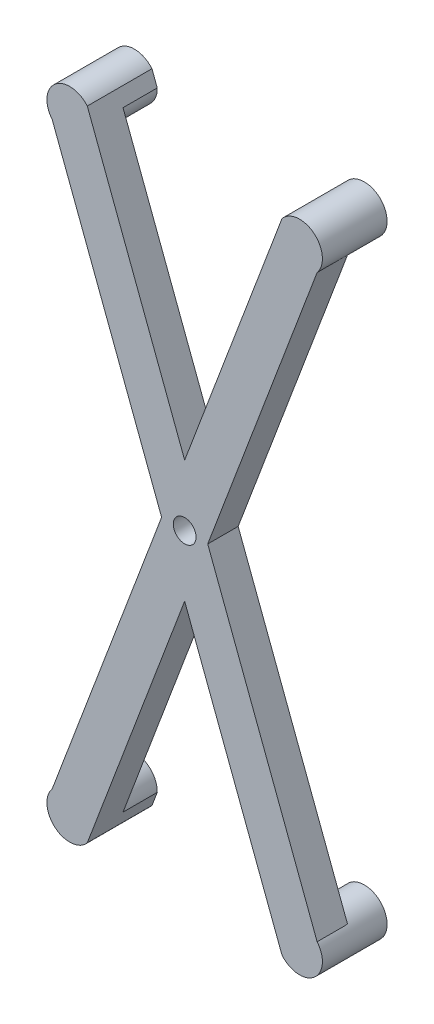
ISO-10303-21;
HEADER;
FILE_DESCRIPTION(('STEP AP214'),'2;1');
FILE_NAME('part.step','',(''),(''),'','','');
FILE_SCHEMA(('AUTOMOTIVE_DESIGN { 1 0 10303 214 1 1 1 1 }'));
ENDSEC;
DATA;
#1=APPLICATION_CONTEXT('core data for automotive mechanical design processes');
#2=APPLICATION_PROTOCOL_DEFINITION('international standard','automotive_design',2000,#1);
#3=PRODUCT_CONTEXT('',#1,'mechanical');
#4=PRODUCT('Part','Part','',(#3));
#5=PRODUCT_RELATED_PRODUCT_CATEGORY('part','',(#4));
#6=PRODUCT_DEFINITION_FORMATION('','',#4);
#7=PRODUCT_DEFINITION_CONTEXT('part definition',#1,'design');
#8=PRODUCT_DEFINITION('design','',#6,#7);
#9=PRODUCT_DEFINITION_SHAPE('','',#8);
#10=(LENGTH_UNIT() NAMED_UNIT(*) SI_UNIT(.MILLI.,.METRE.));
#11=(NAMED_UNIT(*) PLANE_ANGLE_UNIT() SI_UNIT($,.RADIAN.));
#12=(NAMED_UNIT(*) SI_UNIT($,.STERADIAN.) SOLID_ANGLE_UNIT());
#13=UNCERTAINTY_MEASURE_WITH_UNIT(LENGTH_MEASURE(1.E-05),#10,'distance_accuracy_value','');
#14=(GEOMETRIC_REPRESENTATION_CONTEXT(3) GLOBAL_UNCERTAINTY_ASSIGNED_CONTEXT((#13)) GLOBAL_UNIT_ASSIGNED_CONTEXT((#10,
#11,#12)) REPRESENTATION_CONTEXT('',''));
#15=CARTESIAN_POINT('',(0.,0.,0.));
#16=DIRECTION('',(0.,0.,1.));
#17=DIRECTION('',(1.,0.,0.));
#18=AXIS2_PLACEMENT_3D('',#15,#16,#17);
#19=CARTESIAN_POINT('',(0.,0.,0.));
#20=DIRECTION('',(0.,0.,1.));
#21=DIRECTION('',(1.,0.,0.));
#22=AXIS2_PLACEMENT_3D('',#19,#20,#21);
#23=PLANE('',#22);
#24=CARTESIAN_POINT('',(-42.7199448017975,0.467880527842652,0.));
#25=DIRECTION('',(0.,0.,1.));
#26=DIRECTION('',(1.,0.,0.));
#27=AXIS2_PLACEMENT_3D('',#24,#25,#26);
#28=CIRCLE('',#27,1.5);
#29=CARTESIAN_POINT('',(-41.2199448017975,0.467880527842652,0.));
#30=VERTEX_POINT('',#29);
#31=EDGE_CURVE('E297',#30,#30,#28,.T.);
#32=ORIENTED_EDGE('',*,*,#31,.T.);
#33=EDGE_LOOP('',(#32));
#34=FACE_BOUND('',#33,.T.);
#35=CARTESIAN_POINT('',(-27.6199448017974,-39.5321194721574,0.));
#36=DIRECTION('',(0.,0.,-1.));
#37=DIRECTION('',(-1.,0.,0.));
#38=AXIS2_PLACEMENT_3D('',#35,#36,#37);
#39=CIRCLE('',#38,2.99999999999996);
#40=CARTESIAN_POINT('',(-30.618836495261,-39.6136584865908,0.));
#41=VERTEX_POINT('',#40);
#42=CARTESIAN_POINT('',(-25.3152809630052,-37.6115662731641,0.));
#43=VERTEX_POINT('',#42);
#44=EDGE_CURVE('E379',#41,#43,#39,.T.);
#45=ORIENTED_EDGE('',*,*,#44,.F.);
#46=DIRECTION('',(0.353173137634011,-0.935557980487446,0.));
#47=VECTOR('',#46,1.);
#48=CARTESIAN_POINT('',(-39.8886155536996,-15.0579523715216,0.));
#49=LINE('',#48,#47);
#50=CARTESIAN_POINT('',(-42.7199448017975,-7.55774244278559,0.));
#51=VERTEX_POINT('',#50);
#52=EDGE_CURVE('E289',#51,#41,#49,.T.);
#53=ORIENTED_EDGE('',*,*,#52,.F.);
#54=DIRECTION('',(-0.353173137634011,-0.935557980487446,0.));
#55=VECTOR('',#54,1.);
#56=CARTESIAN_POINT('',(-34.8942485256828,13.1725788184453,0.));
#57=LINE('',#56,#55);
#58=CARTESIAN_POINT('',(-54.8210531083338,-39.6136584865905,0.));
#59=VERTEX_POINT('',#58);
#60=EDGE_CURVE('E167',#51,#59,#57,.T.);
#61=ORIENTED_EDGE('',*,*,#60,.T.);
#62=CARTESIAN_POINT('',(-57.8199448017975,-39.5321194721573,0.));
#63=DIRECTION('',(0.,0.,-1.));
#64=DIRECTION('',(-1.,0.,0.));
#65=AXIS2_PLACEMENT_3D('',#62,#63,#64);
#66=CIRCLE('',#65,3.);
#67=CARTESIAN_POINT('',(-60.1246086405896,-37.6115662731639,0.));
#68=VERTEX_POINT('',#67);
#69=EDGE_CURVE('E418',#68,#59,#66,.T.);
#70=ORIENTED_EDGE('',*,*,#69,.F.);
#71=DIRECTION('',(-0.353173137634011,-0.935557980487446,0.));
#72=VECTOR('',#71,1.);
#73=CARTESIAN_POINT('',(-40.1978040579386,15.1746710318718,0.));
#74=LINE('',#73,#72);
#75=CARTESIAN_POINT('',(-45.7496174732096,0.467880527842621,0.));
#76=VERTEX_POINT('',#75);
#77=EDGE_CURVE('E285',#76,#68,#74,.T.);
#78=ORIENTED_EDGE('',*,*,#77,.F.);
#79=DIRECTION('',(0.353173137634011,-0.935557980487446,0.));
#80=VECTOR('',#79,1.);
#81=CARTESIAN_POINT('',(-39.8886155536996,-15.0579523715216,0.));
#82=LINE('',#81,#80);
#83=CARTESIAN_POINT('',(-60.1246086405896,38.5473273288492,0.));
#84=VERTEX_POINT('',#83);
#85=EDGE_CURVE('E281',#84,#76,#82,.T.);
#86=ORIENTED_EDGE('',*,*,#85,.F.);
#87=CARTESIAN_POINT('',(-57.8199448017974,40.4678805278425,0.));
#88=DIRECTION('',(0.,0.,-1.));
#89=DIRECTION('',(-1.,0.,0.));
#90=AXIS2_PLACEMENT_3D('',#87,#88,#89);
#91=CIRCLE('',#90,2.99999999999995);
#92=CARTESIAN_POINT('',(-54.8210531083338,40.5494195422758,0.));
#93=VERTEX_POINT('',#92);
#94=EDGE_CURVE('E346',#93,#84,#91,.T.);
#95=ORIENTED_EDGE('',*,*,#94,.F.);
#96=DIRECTION('',(0.353173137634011,-0.935557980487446,0.));
#97=VECTOR('',#96,1.);
#98=CARTESIAN_POINT('',(-34.5850600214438,-13.055860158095,0.));
#99=LINE('',#98,#97);
#100=CARTESIAN_POINT('',(-42.7199448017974,8.49350349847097,0.));
#101=VERTEX_POINT('',#100);
#102=EDGE_CURVE('E279',#93,#101,#99,.T.);
#103=ORIENTED_EDGE('',*,*,#102,.T.);
#104=DIRECTION('',(-0.353173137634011,-0.935557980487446,0.));
#105=VECTOR('',#104,1.);
#106=CARTESIAN_POINT('',(-40.1978040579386,15.1746710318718,0.));
#107=LINE('',#106,#105);
#108=CARTESIAN_POINT('',(-30.6188364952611,40.5494195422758,0.));
#109=VERTEX_POINT('',#108);
#110=EDGE_CURVE('E205',#109,#101,#107,.T.);
#111=ORIENTED_EDGE('',*,*,#110,.F.);
#112=CARTESIAN_POINT('',(-27.6199448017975,40.4678805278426,0.));
#113=DIRECTION('',(0.,0.,1.));
#114=DIRECTION('',(1.,0.,0.));
#115=AXIS2_PLACEMENT_3D('',#112,#113,#114);
#116=CIRCLE('',#115,3.);
#117=CARTESIAN_POINT('',(-25.3152809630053,38.5473273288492,0.));
#118=VERTEX_POINT('',#117);
#119=EDGE_CURVE('E12',#118,#109,#116,.F.);
#120=ORIENTED_EDGE('',*,*,#119,.F.);
#121=DIRECTION('',(-0.353173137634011,-0.935557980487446,0.));
#122=VECTOR('',#121,1.);
#123=CARTESIAN_POINT('',(-34.8942485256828,13.1725788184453,0.));
#124=LINE('',#123,#122);
#125=CARTESIAN_POINT('',(-39.6902721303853,0.467880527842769,0.));
#126=VERTEX_POINT('',#125);
#127=EDGE_CURVE('E253',#118,#126,#124,.T.);
#128=ORIENTED_EDGE('',*,*,#127,.T.);
#129=DIRECTION('',(0.353173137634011,-0.935557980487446,0.));
#130=VECTOR('',#129,1.);
#131=CARTESIAN_POINT('',(-34.5850600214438,-13.055860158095,0.));
#132=LINE('',#131,#130);
#133=EDGE_CURVE('E292',#126,#43,#132,.T.);
#134=ORIENTED_EDGE('',*,*,#133,.T.);
#135=EDGE_LOOP('',(#45,#53,#61,#70,#78,#86,#95,#103,#111,#120,#128,#134));
#136=FACE_BOUND('',#135,.T.);
#137=ADVANCED_FACE('F152',(#34,#136),#23,.F.);
#138=CARTESIAN_POINT('',(-42.7199448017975,0.467880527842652,4.));
#139=DIRECTION('',(0.,0.,-1.));
#140=DIRECTION('',(-1.,0.,0.));
#141=AXIS2_PLACEMENT_3D('',#138,#139,#140);
#142=CYLINDRICAL_SURFACE('',#141,1.5);
#143=CARTESIAN_POINT('',(-42.7199448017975,0.467880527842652,4.));
#144=DIRECTION('',(0.,0.,1.));
#145=DIRECTION('',(1.,0.,0.));
#146=AXIS2_PLACEMENT_3D('',#143,#144,#145);
#147=CIRCLE('',#146,1.5);
#148=CARTESIAN_POINT('',(-41.2199448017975,0.467880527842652,4.));
#149=VERTEX_POINT('',#148);
#150=EDGE_CURVE('E275',#149,#149,#147,.T.);
#151=ORIENTED_EDGE('',*,*,#150,.T.);
#152=EDGE_LOOP('',(#151));
#153=FACE_BOUND('',#152,.T.);
#154=ORIENTED_EDGE('',*,*,#31,.F.);
#155=EDGE_LOOP('',(#154));
#156=FACE_BOUND('',#155,.T.);
#157=ADVANCED_FACE('F487',(#153,#156),#142,.F.);
#158=CARTESIAN_POINT('',(-57.8199448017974,40.4678805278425,4.));
#159=DIRECTION('',(0.,0.,-1.));
#160=DIRECTION('',(-1.,0.,0.));
#161=AXIS2_PLACEMENT_3D('',#158,#159,#160);
#162=CYLINDRICAL_SURFACE('',#161,2.99999999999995);
#163=DIRECTION('',(0.,0.,-1.));
#164=VECTOR('',#163,1.);
#165=CARTESIAN_POINT('',(-55.5152809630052,42.3884337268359,4.));
#166=LINE('',#165,#164);
#167=CARTESIAN_POINT('',(-55.5152809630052,42.3884337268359,4.));
#168=VERTEX_POINT('',#167);
#169=CARTESIAN_POINT('',(-55.5152809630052,42.3884337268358,-4.5));
#170=VERTEX_POINT('',#169);
#171=EDGE_CURVE('E160',#168,#170,#166,.T.);
#172=ORIENTED_EDGE('',*,*,#171,.T.);
#173=CARTESIAN_POINT('',(-57.8199448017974,40.4678805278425,-4.5));
#174=DIRECTION('',(0.,0.,-1.));
#175=DIRECTION('',(-1.,0.,0.));
#176=AXIS2_PLACEMENT_3D('',#173,#174,#175);
#177=CIRCLE('',#176,2.99999999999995);
#178=CARTESIAN_POINT('',(-54.8210531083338,40.5494195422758,-4.5));
#179=VERTEX_POINT('',#178);
#180=EDGE_CURVE('E330',#179,#170,#177,.T.);
#181=ORIENTED_EDGE('',*,*,#180,.F.);
#182=DIRECTION('',(0.,0.,1.));
#183=VECTOR('',#182,1.);
#184=CARTESIAN_POINT('',(-54.8210531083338,40.5494195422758,-4.5));
#185=LINE('',#184,#183);
#186=EDGE_CURVE('E282',#179,#93,#185,.T.);
#187=ORIENTED_EDGE('',*,*,#186,.T.);
#188=ORIENTED_EDGE('',*,*,#94,.T.);
#189=DIRECTION('',(0.,0.,-1.));
#190=VECTOR('',#189,1.);
#191=CARTESIAN_POINT('',(-60.1246086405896,38.5473273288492,4.));
#192=LINE('',#191,#190);
#193=CARTESIAN_POINT('',(-60.1246086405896,38.5473273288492,4.));
#194=VERTEX_POINT('',#193);
#195=EDGE_CURVE('E322',#194,#84,#192,.T.);
#196=ORIENTED_EDGE('',*,*,#195,.F.);
#197=CARTESIAN_POINT('',(-57.8199448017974,40.4678805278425,4.));
#198=DIRECTION('',(0.,0.,1.));
#199=DIRECTION('',(1.,0.,0.));
#200=AXIS2_PLACEMENT_3D('',#197,#198,#199);
#201=CIRCLE('',#200,2.99999999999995);
#202=EDGE_CURVE('E334',#168,#194,#201,.T.);
#203=ORIENTED_EDGE('',*,*,#202,.F.);
#204=EDGE_LOOP('',(#172,#181,#187,#188,#196,#203));
#205=FACE_BOUND('',#204,.T.);
#206=ADVANCED_FACE('F327',(#205),#162,.T.);
#207=CARTESIAN_POINT('',(-39.8886155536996,-15.0579523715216,4.));
#208=DIRECTION('',(0.935557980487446,0.353173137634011,0.));
#209=DIRECTION('',(-0.353173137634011,0.935557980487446,0.));
#210=AXIS2_PLACEMENT_3D('',#207,#208,#209);
#211=PLANE('',#210);
#212=ORIENTED_EDGE('',*,*,#85,.T.);
#213=DIRECTION('',(0.,0.,-1.));
#214=VECTOR('',#213,1.);
#215=CARTESIAN_POINT('',(-45.7496174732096,0.467880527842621,4.));
#216=LINE('',#215,#214);
#217=CARTESIAN_POINT('',(-45.7496174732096,0.467880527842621,4.));
#218=VERTEX_POINT('',#217);
#219=EDGE_CURVE('E319',#218,#76,#216,.T.);
#220=ORIENTED_EDGE('',*,*,#219,.F.);
#221=DIRECTION('',(0.353173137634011,-0.935557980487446,0.));
#222=VECTOR('',#221,1.);
#223=CARTESIAN_POINT('',(-39.8886155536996,-15.0579523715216,4.));
#224=LINE('',#223,#222);
#225=EDGE_CURVE('E358',#194,#218,#224,.T.);
#226=ORIENTED_EDGE('',*,*,#225,.F.);
#227=ORIENTED_EDGE('',*,*,#195,.T.);
#228=EDGE_LOOP('',(#212,#220,#226,#227));
#229=FACE_BOUND('',#228,.T.);
#230=ADVANCED_FACE('F558',(#229),#211,.F.);
#231=CARTESIAN_POINT('',(-40.1978040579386,15.1746710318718,4.));
#232=DIRECTION('',(0.935557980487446,-0.353173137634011,0.));
#233=DIRECTION('',(0.353173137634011,0.935557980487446,0.));
#234=AXIS2_PLACEMENT_3D('',#231,#232,#233);
#235=PLANE('',#234);
#236=ORIENTED_EDGE('',*,*,#77,.T.);
#237=DIRECTION('',(0.,0.,-1.));
#238=VECTOR('',#237,1.);
#239=CARTESIAN_POINT('',(-60.1246086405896,-37.6115662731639,4.));
#240=LINE('',#239,#238);
#241=CARTESIAN_POINT('',(-60.1246086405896,-37.6115662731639,4.));
#242=VERTEX_POINT('',#241);
#243=EDGE_CURVE('E316',#242,#68,#240,.T.);
#244=ORIENTED_EDGE('',*,*,#243,.F.);
#245=DIRECTION('',(-0.353173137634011,-0.935557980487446,0.));
#246=VECTOR('',#245,1.);
#247=CARTESIAN_POINT('',(-40.1978040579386,15.1746710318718,4.));
#248=LINE('',#247,#246);
#249=EDGE_CURVE('E361',#218,#242,#248,.T.);
#250=ORIENTED_EDGE('',*,*,#249,.F.);
#251=ORIENTED_EDGE('',*,*,#219,.T.);
#252=EDGE_LOOP('',(#236,#244,#250,#251));
#253=FACE_BOUND('',#252,.T.);
#254=ADVANCED_FACE('F554',(#253),#235,.F.);
#255=CARTESIAN_POINT('',(-57.8199448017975,-39.5321194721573,4.));
#256=DIRECTION('',(0.,0.,-1.));
#257=DIRECTION('',(-1.,0.,0.));
#258=AXIS2_PLACEMENT_3D('',#255,#256,#257);
#259=CYLINDRICAL_SURFACE('',#258,3.);
#260=ORIENTED_EDGE('',*,*,#243,.T.);
#261=ORIENTED_EDGE('',*,*,#69,.T.);
#262=DIRECTION('',(0.,0.,1.));
#263=VECTOR('',#262,1.);
#264=CARTESIAN_POINT('',(-54.8210531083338,-39.6136584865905,-4.5));
#265=LINE('',#264,#263);
#266=CARTESIAN_POINT('',(-54.8210531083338,-39.6136584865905,-4.5));
#267=VERTEX_POINT('',#266);
#268=EDGE_CURVE('E404',#267,#59,#265,.T.);
#269=ORIENTED_EDGE('',*,*,#268,.F.);
#270=CARTESIAN_POINT('',(-57.8199448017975,-39.5321194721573,-4.5));
#271=DIRECTION('',(0.,0.,-1.));
#272=DIRECTION('',(-1.,0.,0.));
#273=AXIS2_PLACEMENT_3D('',#270,#271,#272);
#274=CIRCLE('',#273,3.);
#275=CARTESIAN_POINT('',(-55.5152809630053,-41.4526726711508,-4.5));
#276=VERTEX_POINT('',#275);
#277=EDGE_CURVE('E409',#276,#267,#274,.T.);
#278=ORIENTED_EDGE('',*,*,#277,.F.);
#279=DIRECTION('',(0.,0.,-1.));
#280=VECTOR('',#279,1.);
#281=CARTESIAN_POINT('',(-55.5152809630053,-41.4526726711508,4.));
#282=LINE('',#281,#280);
#283=CARTESIAN_POINT('',(-55.5152809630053,-41.4526726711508,4.));
#284=VERTEX_POINT('',#283);
#285=EDGE_CURVE('E313',#284,#276,#282,.T.);
#286=ORIENTED_EDGE('',*,*,#285,.F.);
#287=CARTESIAN_POINT('',(-57.8199448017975,-39.5321194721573,4.));
#288=DIRECTION('',(0.,0.,1.));
#289=DIRECTION('',(1.,0.,0.));
#290=AXIS2_PLACEMENT_3D('',#287,#288,#289);
#291=CIRCLE('',#290,3.);
#292=EDGE_CURVE('E364',#242,#284,#291,.T.);
#293=ORIENTED_EDGE('',*,*,#292,.F.);
#294=EDGE_LOOP('',(#260,#261,#269,#278,#286,#293));
#295=FACE_BOUND('',#294,.T.);
#296=ADVANCED_FACE('F551',(#295),#259,.T.);
#297=CARTESIAN_POINT('',(-34.8942485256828,13.1725788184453,4.));
#298=DIRECTION('',(0.935557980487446,-0.353173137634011,0.));
#299=DIRECTION('',(0.353173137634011,0.935557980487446,0.));
#300=AXIS2_PLACEMENT_3D('',#297,#298,#299);
#301=PLANE('',#300);
#302=ORIENTED_EDGE('',*,*,#60,.F.);
#303=DIRECTION('',(0.,0.,-1.));
#304=VECTOR('',#303,1.);
#305=CARTESIAN_POINT('',(-42.7199448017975,-7.55774244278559,4.));
#306=LINE('',#305,#304);
#307=CARTESIAN_POINT('',(-42.7199448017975,-7.55774244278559,4.));
#308=VERTEX_POINT('',#307);
#309=EDGE_CURVE('E311',#308,#51,#306,.T.);
#310=ORIENTED_EDGE('',*,*,#309,.F.);
#311=DIRECTION('',(-0.353173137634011,-0.935557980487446,0.));
#312=VECTOR('',#311,1.);
#313=CARTESIAN_POINT('',(-34.8942485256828,13.1725788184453,4.));
#314=LINE('',#313,#312);
#315=EDGE_CURVE('E366',#308,#284,#314,.T.);
#316=ORIENTED_EDGE('',*,*,#315,.T.);
#317=ORIENTED_EDGE('',*,*,#285,.T.);
#318=DIRECTION('',(-0.353173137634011,-0.935557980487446,0.));
#319=VECTOR('',#318,1.);
#320=CARTESIAN_POINT('',(-34.8942485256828,13.1725788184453,-4.5));
#321=LINE('',#320,#319);
#322=EDGE_CURVE('E415',#267,#276,#321,.T.);
#323=ORIENTED_EDGE('',*,*,#322,.F.);
#324=ORIENTED_EDGE('',*,*,#268,.T.);
#325=EDGE_LOOP('',(#302,#310,#316,#317,#323,#324));
#326=FACE_BOUND('',#325,.T.);
#327=ADVANCED_FACE('F547',(#326),#301,.T.);
#328=CARTESIAN_POINT('',(-39.8886155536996,-15.0579523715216,4.));
#329=DIRECTION('',(0.935557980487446,0.353173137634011,0.));
#330=DIRECTION('',(-0.353173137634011,0.935557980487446,0.));
#331=AXIS2_PLACEMENT_3D('',#328,#329,#330);
#332=PLANE('',#331);
#333=ORIENTED_EDGE('',*,*,#52,.T.);
#334=DIRECTION('',(0.,0.,1.));
#335=VECTOR('',#334,1.);
#336=CARTESIAN_POINT('',(-30.618836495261,-39.6136584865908,-4.5));
#337=LINE('',#336,#335);
#338=CARTESIAN_POINT('',(-30.618836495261,-39.6136584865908,-4.5));
#339=VERTEX_POINT('',#338);
#340=EDGE_CURVE('E423',#339,#41,#337,.T.);
#341=ORIENTED_EDGE('',*,*,#340,.F.);
#342=DIRECTION('',(-0.353173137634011,0.935557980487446,0.));
#343=VECTOR('',#342,1.);
#344=CARTESIAN_POINT('',(-39.8886155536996,-15.0579523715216,-4.5));
#345=LINE('',#344,#343);
#346=CARTESIAN_POINT('',(-29.9246086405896,-41.4526726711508,-4.5));
#347=VERTEX_POINT('',#346);
#348=EDGE_CURVE('E430',#347,#339,#345,.T.);
#349=ORIENTED_EDGE('',*,*,#348,.F.);
#350=DIRECTION('',(0.,0.,-1.));
#351=VECTOR('',#350,1.);
#352=CARTESIAN_POINT('',(-29.9246086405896,-41.4526726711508,4.));
#353=LINE('',#352,#351);
#354=CARTESIAN_POINT('',(-29.9246086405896,-41.4526726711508,4.));
#355=VERTEX_POINT('',#354);
#356=EDGE_CURVE('E308',#355,#347,#353,.T.);
#357=ORIENTED_EDGE('',*,*,#356,.F.);
#358=DIRECTION('',(0.353173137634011,-0.935557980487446,0.));
#359=VECTOR('',#358,1.);
#360=CARTESIAN_POINT('',(-39.8886155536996,-15.0579523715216,4.));
#361=LINE('',#360,#359);
#362=EDGE_CURVE('E369',#308,#355,#361,.T.);
#363=ORIENTED_EDGE('',*,*,#362,.F.);
#364=ORIENTED_EDGE('',*,*,#309,.T.);
#365=EDGE_LOOP('',(#333,#341,#349,#357,#363,#364));
#366=FACE_BOUND('',#365,.T.);
#367=ADVANCED_FACE('F544',(#366),#332,.F.);
#368=CARTESIAN_POINT('',(-27.6199448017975,-39.5321194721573,4.));
#369=DIRECTION('',(0.,0.,-1.));
#370=DIRECTION('',(-1.,0.,0.));
#371=AXIS2_PLACEMENT_3D('',#368,#369,#370);
#372=CYLINDRICAL_SURFACE('',#371,3.);
#373=ORIENTED_EDGE('',*,*,#356,.T.);
#374=CARTESIAN_POINT('',(-27.6199448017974,-39.5321194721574,-4.5));
#375=DIRECTION('',(0.,0.,-1.));
#376=DIRECTION('',(-1.,0.,0.));
#377=AXIS2_PLACEMENT_3D('',#374,#375,#376);
#378=CIRCLE('',#377,2.99999999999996);
#379=EDGE_CURVE('E438',#339,#347,#378,.T.);
#380=ORIENTED_EDGE('',*,*,#379,.F.);
#381=ORIENTED_EDGE('',*,*,#340,.T.);
#382=ORIENTED_EDGE('',*,*,#44,.T.);
#383=DIRECTION('',(0.,0.,-1.));
#384=VECTOR('',#383,1.);
#385=CARTESIAN_POINT('',(-25.3152809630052,-37.6115662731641,4.));
#386=LINE('',#385,#384);
#387=CARTESIAN_POINT('',(-25.3152809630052,-37.6115662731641,4.));
#388=VERTEX_POINT('',#387);
#389=EDGE_CURVE('E305',#388,#43,#386,.T.);
#390=ORIENTED_EDGE('',*,*,#389,.F.);
#391=CARTESIAN_POINT('',(-27.6199448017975,-39.5321194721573,4.));
#392=DIRECTION('',(0.,0.,1.));
#393=DIRECTION('',(1.,0.,0.));
#394=AXIS2_PLACEMENT_3D('',#391,#392,#393);
#395=CIRCLE('',#394,3.);
#396=EDGE_CURVE('E270',#355,#388,#395,.T.);
#397=ORIENTED_EDGE('',*,*,#396,.F.);
#398=EDGE_LOOP('',(#373,#380,#381,#382,#390,#397));
#399=FACE_BOUND('',#398,.T.);
#400=ADVANCED_FACE('F376',(#399),#372,.T.);
#401=CARTESIAN_POINT('',(-34.5850600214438,-13.055860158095,4.));
#402=DIRECTION('',(0.935557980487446,0.353173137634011,0.));
#403=DIRECTION('',(-0.353173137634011,0.935557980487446,0.));
#404=AXIS2_PLACEMENT_3D('',#401,#402,#403);
#405=PLANE('',#404);
#406=ORIENTED_EDGE('',*,*,#133,.F.);
#407=DIRECTION('',(0.,0.,-1.));
#408=VECTOR('',#407,1.);
#409=CARTESIAN_POINT('',(-39.6902721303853,0.467880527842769,4.));
#410=LINE('',#409,#408);
#411=CARTESIAN_POINT('',(-39.6902721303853,0.467880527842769,4.));
#412=VERTEX_POINT('',#411);
#413=EDGE_CURVE('E255',#412,#126,#410,.T.);
#414=ORIENTED_EDGE('',*,*,#413,.F.);
#415=DIRECTION('',(0.353173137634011,-0.935557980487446,0.));
#416=VECTOR('',#415,1.);
#417=CARTESIAN_POINT('',(-34.5850600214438,-13.055860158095,4.));
#418=LINE('',#417,#416);
#419=EDGE_CURVE('E268',#412,#388,#418,.T.);
#420=ORIENTED_EDGE('',*,*,#419,.T.);
#421=ORIENTED_EDGE('',*,*,#389,.T.);
#422=EDGE_LOOP('',(#406,#414,#420,#421));
#423=FACE_BOUND('',#422,.T.);
#424=ADVANCED_FACE('F382',(#423),#405,.T.);
#425=CARTESIAN_POINT('',(-34.8942485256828,13.1725788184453,4.));
#426=DIRECTION('',(0.935557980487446,-0.353173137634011,0.));
#427=DIRECTION('',(0.353173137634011,0.935557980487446,0.));
#428=AXIS2_PLACEMENT_3D('',#425,#426,#427);
#429=PLANE('',#428);
#430=ORIENTED_EDGE('',*,*,#127,.F.);
#431=DIRECTION('',(0.,0.,-1.));
#432=VECTOR('',#431,1.);
#433=CARTESIAN_POINT('',(-25.3152809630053,38.5473273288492,4.));
#434=LINE('',#433,#432);
#435=CARTESIAN_POINT('',(-25.3152809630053,38.5473273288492,4.));
#436=VERTEX_POINT('',#435);
#437=EDGE_CURVE('E246',#436,#118,#434,.T.);
#438=ORIENTED_EDGE('',*,*,#437,.F.);
#439=DIRECTION('',(-0.353173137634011,-0.935557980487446,0.));
#440=VECTOR('',#439,1.);
#441=CARTESIAN_POINT('',(-34.8942485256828,13.1725788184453,4.));
#442=LINE('',#441,#440);
#443=EDGE_CURVE('E250',#436,#412,#442,.T.);
#444=ORIENTED_EDGE('',*,*,#443,.T.);
#445=ORIENTED_EDGE('',*,*,#413,.T.);
#446=EDGE_LOOP('',(#430,#438,#444,#445));
#447=FACE_BOUND('',#446,.T.);
#448=ADVANCED_FACE('F248',(#447),#429,.T.);
#449=CARTESIAN_POINT('',(-27.6199448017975,40.4678805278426,4.));
#450=DIRECTION('',(0.,0.,-1.));
#451=DIRECTION('',(-1.,0.,0.));
#452=AXIS2_PLACEMENT_3D('',#449,#450,#451);
#453=CYLINDRICAL_SURFACE('',#452,3.);
#454=ORIENTED_EDGE('',*,*,#437,.T.);
#455=ORIENTED_EDGE('',*,*,#119,.T.);
#456=DIRECTION('',(0.,0.,1.));
#457=VECTOR('',#456,1.);
#458=CARTESIAN_POINT('',(-30.6188364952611,40.5494195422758,-4.5));
#459=LINE('',#458,#457);
#460=CARTESIAN_POINT('',(-30.6188364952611,40.5494195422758,-4.5));
#461=VERTEX_POINT('',#460);
#462=EDGE_CURVE('E349',#461,#109,#459,.T.);
#463=ORIENTED_EDGE('',*,*,#462,.F.);
#464=CARTESIAN_POINT('',(-27.6199448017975,40.4678805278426,-4.5));
#465=DIRECTION('',(0.,0.,-1.));
#466=DIRECTION('',(-1.,0.,0.));
#467=AXIS2_PLACEMENT_3D('',#464,#465,#466);
#468=CIRCLE('',#467,3.);
#469=CARTESIAN_POINT('',(-29.9246086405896,42.3884337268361,-4.5));
#470=VERTEX_POINT('',#469);
#471=EDGE_CURVE('E395',#470,#461,#468,.T.);
#472=ORIENTED_EDGE('',*,*,#471,.F.);
#473=DIRECTION('',(0.,0.,-1.));
#474=VECTOR('',#473,1.);
#475=CARTESIAN_POINT('',(-29.9246086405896,42.3884337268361,4.));
#476=LINE('',#475,#474);
#477=CARTESIAN_POINT('',(-29.9246086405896,42.3884337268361,4.));
#478=VERTEX_POINT('',#477);
#479=EDGE_CURVE('E256',#478,#470,#476,.T.);
#480=ORIENTED_EDGE('',*,*,#479,.F.);
#481=CARTESIAN_POINT('',(-27.6199448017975,40.4678805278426,4.));
#482=DIRECTION('',(0.,0.,1.));
#483=DIRECTION('',(1.,0.,0.));
#484=AXIS2_PLACEMENT_3D('',#481,#482,#483);
#485=CIRCLE('',#484,3.);
#486=EDGE_CURVE('E259',#436,#478,#485,.T.);
#487=ORIENTED_EDGE('',*,*,#486,.F.);
#488=EDGE_LOOP('',(#454,#455,#463,#472,#480,#487));
#489=FACE_BOUND('',#488,.T.);
#490=ADVANCED_FACE('F260',(#489),#453,.T.);
#491=CARTESIAN_POINT('',(-40.1978040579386,15.1746710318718,4.));
#492=DIRECTION('',(0.935557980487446,-0.353173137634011,0.));
#493=DIRECTION('',(0.353173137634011,0.935557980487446,0.));
#494=AXIS2_PLACEMENT_3D('',#491,#492,#493);
#495=PLANE('',#494);
#496=ORIENTED_EDGE('',*,*,#479,.T.);
#497=DIRECTION('',(0.353173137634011,0.935557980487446,0.));
#498=VECTOR('',#497,1.);
#499=CARTESIAN_POINT('',(-40.1978040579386,15.1746710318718,-4.5));
#500=LINE('',#499,#498);
#501=EDGE_CURVE('E394',#461,#470,#500,.T.);
#502=ORIENTED_EDGE('',*,*,#501,.F.);
#503=ORIENTED_EDGE('',*,*,#462,.T.);
#504=ORIENTED_EDGE('',*,*,#110,.T.);
#505=DIRECTION('',(0.,0.,-1.));
#506=VECTOR('',#505,1.);
#507=CARTESIAN_POINT('',(-42.7199448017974,8.49350349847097,4.));
#508=LINE('',#507,#506);
#509=CARTESIAN_POINT('',(-42.7199448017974,8.49350349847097,4.));
#510=VERTEX_POINT('',#509);
#511=EDGE_CURVE('E278',#510,#101,#508,.T.);
#512=ORIENTED_EDGE('',*,*,#511,.F.);
#513=DIRECTION('',(-0.353173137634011,-0.935557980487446,0.));
#514=VECTOR('',#513,1.);
#515=CARTESIAN_POINT('',(-40.1978040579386,15.1746710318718,4.));
#516=LINE('',#515,#514);
#517=EDGE_CURVE('E176',#478,#510,#516,.T.);
#518=ORIENTED_EDGE('',*,*,#517,.F.);
#519=EDGE_LOOP('',(#496,#502,#503,#504,#512,#518));
#520=FACE_BOUND('',#519,.T.);
#521=ADVANCED_FACE('F392',(#520),#495,.F.);
#522=CARTESIAN_POINT('',(-34.5850600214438,-13.055860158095,4.));
#523=DIRECTION('',(0.935557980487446,0.353173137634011,0.));
#524=DIRECTION('',(-0.353173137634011,0.935557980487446,0.));
#525=AXIS2_PLACEMENT_3D('',#522,#523,#524);
#526=PLANE('',#525);
#527=ORIENTED_EDGE('',*,*,#102,.F.);
#528=ORIENTED_EDGE('',*,*,#186,.F.);
#529=DIRECTION('',(0.353173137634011,-0.935557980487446,0.));
#530=VECTOR('',#529,1.);
#531=CARTESIAN_POINT('',(-34.5850600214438,-13.055860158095,-4.5));
#532=LINE('',#531,#530);
#533=EDGE_CURVE('E338',#170,#179,#532,.T.);
#534=ORIENTED_EDGE('',*,*,#533,.F.);
#535=ORIENTED_EDGE('',*,*,#171,.F.);
#536=DIRECTION('',(0.353173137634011,-0.935557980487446,0.));
#537=VECTOR('',#536,1.);
#538=CARTESIAN_POINT('',(-34.5850600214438,-13.055860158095,4.));
#539=LINE('',#538,#537);
#540=EDGE_CURVE('E300',#168,#510,#539,.T.);
#541=ORIENTED_EDGE('',*,*,#540,.T.);
#542=ORIENTED_EDGE('',*,*,#511,.T.);
#543=EDGE_LOOP('',(#527,#528,#534,#535,#541,#542));
#544=FACE_BOUND('',#543,.T.);
#545=ADVANCED_FACE('F154',(#544),#526,.T.);
#546=CARTESIAN_POINT('',(0.,0.,4.));
#547=DIRECTION('',(0.,0.,1.));
#548=DIRECTION('',(1.,0.,0.));
#549=AXIS2_PLACEMENT_3D('',#546,#547,#548);
#550=PLANE('',#549);
#551=ORIENTED_EDGE('',*,*,#540,.F.);
#552=ORIENTED_EDGE('',*,*,#202,.T.);
#553=ORIENTED_EDGE('',*,*,#225,.T.);
#554=ORIENTED_EDGE('',*,*,#249,.T.);
#555=ORIENTED_EDGE('',*,*,#292,.T.);
#556=ORIENTED_EDGE('',*,*,#315,.F.);
#557=ORIENTED_EDGE('',*,*,#362,.T.);
#558=ORIENTED_EDGE('',*,*,#396,.T.);
#559=ORIENTED_EDGE('',*,*,#419,.F.);
#560=ORIENTED_EDGE('',*,*,#443,.F.);
#561=ORIENTED_EDGE('',*,*,#486,.T.);
#562=ORIENTED_EDGE('',*,*,#517,.T.);
#563=EDGE_LOOP('',(#551,#552,#553,#554,#555,#556,#557,#558,#559,#560,#561,#562));
#564=FACE_BOUND('',#563,.T.);
#565=ORIENTED_EDGE('',*,*,#150,.F.);
#566=EDGE_LOOP('',(#565));
#567=FACE_BOUND('',#566,.T.);
#568=ADVANCED_FACE('F265',(#564,#567),#550,.T.);
#569=CARTESIAN_POINT('',(-57.8199448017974,40.4678805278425,-4.5));
#570=DIRECTION('',(0.,0.,1.));
#571=DIRECTION('',(1.,0.,0.));
#572=AXIS2_PLACEMENT_3D('',#569,#570,#571);
#573=CYLINDRICAL_SURFACE('',#572,1.1);
#574=CARTESIAN_POINT('',(-57.8199448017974,40.4678805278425,-4.5));
#575=DIRECTION('',(0.,0.,-1.));
#576=DIRECTION('',(-1.,0.,0.));
#577=AXIS2_PLACEMENT_3D('',#574,#575,#576);
#578=CIRCLE('',#577,1.1);
#579=CARTESIAN_POINT('',(-58.9199448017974,40.4678805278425,-4.5));
#580=VERTEX_POINT('',#579);
#581=EDGE_CURVE('E340',#580,#580,#578,.T.);
#582=ORIENTED_EDGE('',*,*,#581,.T.);
#583=EDGE_LOOP('',(#582));
#584=FACE_BOUND('',#583,.T.);
#585=CARTESIAN_POINT('',(-57.8199448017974,40.4678805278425,0.));
#586=DIRECTION('',(0.,0.,-1.));
#587=DIRECTION('',(-1.,0.,0.));
#588=AXIS2_PLACEMENT_3D('',#585,#586,#587);
#589=CIRCLE('',#588,1.1);
#590=CARTESIAN_POINT('',(-58.9199448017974,40.4678805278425,0.));
#591=VERTEX_POINT('',#590);
#592=EDGE_CURVE('E343',#591,#591,#589,.T.);
#593=ORIENTED_EDGE('',*,*,#592,.F.);
#594=EDGE_LOOP('',(#593));
#595=FACE_BOUND('',#594,.T.);
#596=ADVANCED_FACE('F515',(#584,#595),#573,.F.);
#597=CARTESIAN_POINT('',(0.,0.,-4.5));
#598=DIRECTION('',(0.,0.,-1.));
#599=DIRECTION('',(-1.,0.,0.));
#600=AXIS2_PLACEMENT_3D('',#597,#598,#599);
#601=PLANE('',#600);
#602=ORIENTED_EDGE('',*,*,#533,.T.);
#603=ORIENTED_EDGE('',*,*,#180,.T.);
#604=EDGE_LOOP('',(#602,#603));
#605=FACE_BOUND('',#604,.T.);
#606=ORIENTED_EDGE('',*,*,#581,.F.);
#607=EDGE_LOOP('',(#606));
#608=FACE_BOUND('',#607,.T.);
#609=ADVANCED_FACE('F336',(#605,#608),#601,.T.);
#610=ORIENTED_EDGE('',*,*,#592,.T.);
#611=EDGE_LOOP('',(#610));
#612=FACE_BOUND('',#611,.T.);
#613=ADVANCED_FACE('F481',(#612),#23,.F.);
#614=CARTESIAN_POINT('',(-27.6199448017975,40.4678805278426,-4.5));
#615=DIRECTION('',(0.,0.,1.));
#616=DIRECTION('',(1.,0.,0.));
#617=AXIS2_PLACEMENT_3D('',#614,#615,#616);
#618=CYLINDRICAL_SURFACE('',#617,1.1);
#619=CARTESIAN_POINT('',(-27.6199448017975,40.4678805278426,-4.5));
#620=DIRECTION('',(0.,0.,-1.));
#621=DIRECTION('',(-1.,0.,0.));
#622=AXIS2_PLACEMENT_3D('',#619,#620,#621);
#623=CIRCLE('',#622,1.1);
#624=CARTESIAN_POINT('',(-28.7199448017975,40.4678805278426,-4.5));
#625=VERTEX_POINT('',#624);
#626=EDGE_CURVE('E399',#625,#625,#623,.T.);
#627=ORIENTED_EDGE('',*,*,#626,.T.);
#628=EDGE_LOOP('',(#627));
#629=FACE_BOUND('',#628,.T.);
#630=CARTESIAN_POINT('',(-27.6199448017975,40.4678805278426,0.));
#631=DIRECTION('',(0.,0.,-1.));
#632=DIRECTION('',(-1.,0.,0.));
#633=AXIS2_PLACEMENT_3D('',#630,#631,#632);
#634=CIRCLE('',#633,1.1);
#635=CARTESIAN_POINT('',(-28.7199448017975,40.4678805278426,0.));
#636=VERTEX_POINT('',#635);
#637=EDGE_CURVE('E402',#636,#636,#634,.T.);
#638=ORIENTED_EDGE('',*,*,#637,.F.);
#639=EDGE_LOOP('',(#638));
#640=FACE_BOUND('',#639,.T.);
#641=ADVANCED_FACE('F472',(#629,#640),#618,.F.);
#642=CARTESIAN_POINT('',(0.,0.,-4.5));
#643=DIRECTION('',(0.,0.,-1.));
#644=DIRECTION('',(-1.,0.,0.));
#645=AXIS2_PLACEMENT_3D('',#642,#643,#644);
#646=PLANE('',#645);
#647=ORIENTED_EDGE('',*,*,#626,.F.);
#648=EDGE_LOOP('',(#647));
#649=FACE_BOUND('',#648,.T.);
#650=ORIENTED_EDGE('',*,*,#501,.T.);
#651=ORIENTED_EDGE('',*,*,#471,.T.);
#652=EDGE_LOOP('',(#650,#651));
#653=FACE_BOUND('',#652,.T.);
#654=ADVANCED_FACE('F469',(#649,#653),#646,.T.);
#655=ORIENTED_EDGE('',*,*,#637,.T.);
#656=EDGE_LOOP('',(#655));
#657=FACE_BOUND('',#656,.T.);
#658=ADVANCED_FACE('F471',(#657),#23,.F.);
#659=CARTESIAN_POINT('',(-57.8199448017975,-39.5321194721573,-4.5));
#660=DIRECTION('',(0.,0.,1.));
#661=DIRECTION('',(1.,0.,0.));
#662=AXIS2_PLACEMENT_3D('',#659,#660,#661);
#663=CYLINDRICAL_SURFACE('',#662,1.1);
#664=CARTESIAN_POINT('',(-57.8199448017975,-39.5321194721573,-4.5));
#665=DIRECTION('',(0.,0.,-1.));
#666=DIRECTION('',(-1.,0.,0.));
#667=AXIS2_PLACEMENT_3D('',#664,#665,#666);
#668=CIRCLE('',#667,1.1);
#669=CARTESIAN_POINT('',(-58.9199448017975,-39.5321194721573,-4.5));
#670=VERTEX_POINT('',#669);
#671=EDGE_CURVE('E420',#670,#670,#668,.T.);
#672=ORIENTED_EDGE('',*,*,#671,.T.);
#673=EDGE_LOOP('',(#672));
#674=FACE_BOUND('',#673,.T.);
#675=CARTESIAN_POINT('',(-57.8199448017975,-39.5321194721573,0.));
#676=DIRECTION('',(0.,0.,-1.));
#677=DIRECTION('',(-1.,0.,0.));
#678=AXIS2_PLACEMENT_3D('',#675,#676,#677);
#679=CIRCLE('',#678,1.1);
#680=CARTESIAN_POINT('',(-58.9199448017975,-39.5321194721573,0.));
#681=VERTEX_POINT('',#680);
#682=EDGE_CURVE('E421',#681,#681,#679,.T.);
#683=ORIENTED_EDGE('',*,*,#682,.F.);
#684=EDGE_LOOP('',(#683));
#685=FACE_BOUND('',#684,.T.);
#686=ADVANCED_FACE('F479',(#674,#685),#663,.F.);
#687=CARTESIAN_POINT('',(0.,0.,-4.5));
#688=DIRECTION('',(0.,0.,-1.));
#689=DIRECTION('',(-1.,0.,0.));
#690=AXIS2_PLACEMENT_3D('',#687,#688,#689);
#691=PLANE('',#690);
#692=ORIENTED_EDGE('',*,*,#671,.F.);
#693=EDGE_LOOP('',(#692));
#694=FACE_BOUND('',#693,.T.);
#695=ORIENTED_EDGE('',*,*,#322,.T.);
#696=ORIENTED_EDGE('',*,*,#277,.T.);
#697=EDGE_LOOP('',(#695,#696));
#698=FACE_BOUND('',#697,.T.);
#699=ADVANCED_FACE('F497',(#694,#698),#691,.T.);
#700=ORIENTED_EDGE('',*,*,#682,.T.);
#701=EDGE_LOOP('',(#700));
#702=FACE_BOUND('',#701,.T.);
#703=ADVANCED_FACE('F489',(#702),#23,.F.);
#704=CARTESIAN_POINT('',(-27.6199448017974,-39.5321194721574,-4.5));
#705=DIRECTION('',(0.,0.,1.));
#706=DIRECTION('',(1.,0.,0.));
#707=AXIS2_PLACEMENT_3D('',#704,#705,#706);
#708=CYLINDRICAL_SURFACE('',#707,1.1);
#709=CARTESIAN_POINT('',(-27.6199448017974,-39.5321194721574,-4.5));
#710=DIRECTION('',(0.,0.,-1.));
#711=DIRECTION('',(-1.,0.,0.));
#712=AXIS2_PLACEMENT_3D('',#709,#710,#711);
#713=CIRCLE('',#712,1.1);
#714=CARTESIAN_POINT('',(-28.7199448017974,-39.5321194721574,-4.5));
#715=VERTEX_POINT('',#714);
#716=EDGE_CURVE('E432',#715,#715,#713,.T.);
#717=ORIENTED_EDGE('',*,*,#716,.T.);
#718=EDGE_LOOP('',(#717));
#719=FACE_BOUND('',#718,.T.);
#720=CARTESIAN_POINT('',(-27.6199448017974,-39.5321194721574,0.));
#721=DIRECTION('',(0.,0.,-1.));
#722=DIRECTION('',(-1.,0.,0.));
#723=AXIS2_PLACEMENT_3D('',#720,#721,#722);
#724=CIRCLE('',#723,1.1);
#725=CARTESIAN_POINT('',(-28.7199448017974,-39.5321194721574,0.));
#726=VERTEX_POINT('',#725);
#727=EDGE_CURVE('E433',#726,#726,#724,.T.);
#728=ORIENTED_EDGE('',*,*,#727,.F.);
#729=EDGE_LOOP('',(#728));
#730=FACE_BOUND('',#729,.T.);
#731=ADVANCED_FACE('F444',(#719,#730),#708,.F.);
#732=CARTESIAN_POINT('',(0.,0.,-4.5));
#733=DIRECTION('',(0.,0.,-1.));
#734=DIRECTION('',(-1.,0.,0.));
#735=AXIS2_PLACEMENT_3D('',#732,#733,#734);
#736=PLANE('',#735);
#737=ORIENTED_EDGE('',*,*,#716,.F.);
#738=EDGE_LOOP('',(#737));
#739=FACE_BOUND('',#738,.T.);
#740=ORIENTED_EDGE('',*,*,#379,.T.);
#741=ORIENTED_EDGE('',*,*,#348,.T.);
#742=EDGE_LOOP('',(#740,#741));
#743=FACE_BOUND('',#742,.T.);
#744=ADVANCED_FACE('F447',(#739,#743),#736,.T.);
#745=ORIENTED_EDGE('',*,*,#727,.T.);
#746=EDGE_LOOP('',(#745));
#747=FACE_BOUND('',#746,.T.);
#748=ADVANCED_FACE('F450',(#747),#23,.F.);
#749=CLOSED_SHELL('',(#137,#157,#206,#230,#254,#296,#327,#367,#400,#424,#448,#490,#521,#545,
#568,#596,#609,#613,#641,#654,#658,#686,#699,#703,#731,#744,#748));
#750=MANIFOLD_SOLID_BREP('B2',#749);
#751=ADVANCED_BREP_SHAPE_REPRESENTATION('',(#18,#750),#14);
#752=SHAPE_DEFINITION_REPRESENTATION(#9,#751);
ENDSEC;
END-ISO-10303-21;
